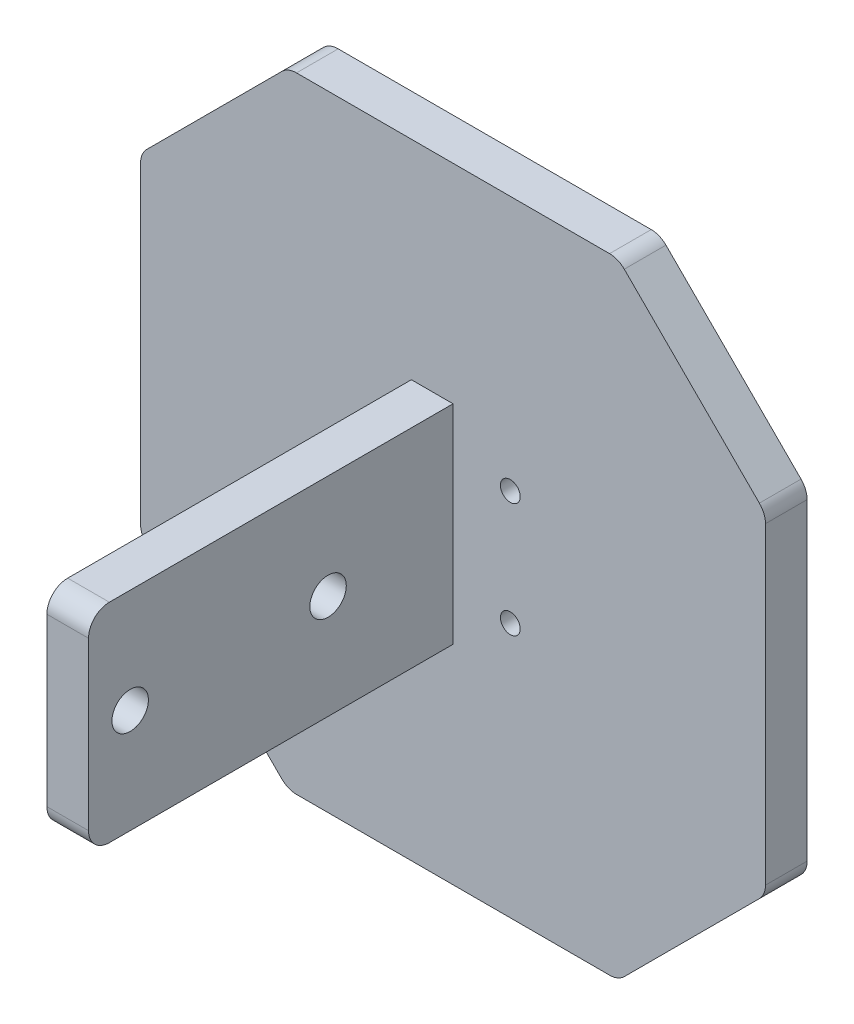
ISO-10303-21;
HEADER;
FILE_DESCRIPTION(('STEP AP214'),'2;1');
FILE_NAME('part.step','',(''),(''),'','','');
FILE_SCHEMA(('AUTOMOTIVE_DESIGN { 1 0 10303 214 1 1 1 1 }'));
ENDSEC;
DATA;
#1=APPLICATION_CONTEXT('core data for automotive mechanical design processes');
#2=APPLICATION_PROTOCOL_DEFINITION('international standard','automotive_design',2000,#1);
#3=PRODUCT_CONTEXT('',#1,'mechanical');
#4=PRODUCT('Part','Part','',(#3));
#5=PRODUCT_RELATED_PRODUCT_CATEGORY('part','',(#4));
#6=PRODUCT_DEFINITION_FORMATION('','',#4);
#7=PRODUCT_DEFINITION_CONTEXT('part definition',#1,'design');
#8=PRODUCT_DEFINITION('design','',#6,#7);
#9=PRODUCT_DEFINITION_SHAPE('','',#8);
#10=(LENGTH_UNIT() NAMED_UNIT(*) SI_UNIT(.MILLI.,.METRE.));
#11=(NAMED_UNIT(*) PLANE_ANGLE_UNIT() SI_UNIT($,.RADIAN.));
#12=(NAMED_UNIT(*) SI_UNIT($,.STERADIAN.) SOLID_ANGLE_UNIT());
#13=UNCERTAINTY_MEASURE_WITH_UNIT(LENGTH_MEASURE(1.E-05),#10,'distance_accuracy_value','');
#14=(GEOMETRIC_REPRESENTATION_CONTEXT(3) GLOBAL_UNCERTAINTY_ASSIGNED_CONTEXT((#13)) GLOBAL_UNIT_ASSIGNED_CONTEXT((#10,
#11,#12)) REPRESENTATION_CONTEXT('',''));
#15=CARTESIAN_POINT('',(0.,0.,0.));
#16=DIRECTION('',(0.,0.,1.));
#17=DIRECTION('',(1.,0.,0.));
#18=AXIS2_PLACEMENT_3D('',#15,#16,#17);
#19=CARTESIAN_POINT('',(0.,0.,4.));
#20=DIRECTION('',(0.,0.,-1.));
#21=DIRECTION('',(-1.,0.,0.));
#22=AXIS2_PLACEMENT_3D('',#19,#20,#21);
#23=PLANE('',#22);
#24=CARTESIAN_POINT('',(5.5,-5.50000000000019,4.));
#25=DIRECTION('',(0.,0.,1.));
#26=DIRECTION('',(1.,0.,0.));
#27=AXIS2_PLACEMENT_3D('',#24,#25,#26);
#28=CIRCLE('',#27,0.949999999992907);
#29=CARTESIAN_POINT('',(6.44999999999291,-5.50000000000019,4.));
#30=VERTEX_POINT('',#29);
#31=EDGE_CURVE('E222',#30,#30,#28,.T.);
#32=ORIENTED_EDGE('',*,*,#31,.F.);
#33=EDGE_LOOP('',(#32));
#34=FACE_BOUND('',#33,.T.);
#35=CARTESIAN_POINT('',(-5.5,-5.50000000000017,4.));
#36=DIRECTION('',(0.,0.,1.));
#37=DIRECTION('',(1.,0.,0.));
#38=AXIS2_PLACEMENT_3D('',#35,#36,#37);
#39=CIRCLE('',#38,0.949999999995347);
#40=CARTESIAN_POINT('',(-4.55000000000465,-5.50000000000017,4.));
#41=VERTEX_POINT('',#40);
#42=EDGE_CURVE('E234',#41,#41,#39,.T.);
#43=ORIENTED_EDGE('',*,*,#42,.F.);
#44=EDGE_LOOP('',(#43));
#45=FACE_BOUND('',#44,.T.);
#46=DIRECTION('',(-0.707106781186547,-0.707106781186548,0.));
#47=VECTOR('',#46,1.);
#48=CARTESIAN_POINT('',(-15.8578643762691,30.,4.));
#49=LINE('',#48,#47);
#50=CARTESIAN_POINT('',(-16.443650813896,29.4142135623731,4.));
#51=VERTEX_POINT('',#50);
#52=CARTESIAN_POINT('',(-29.4142135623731,16.4436508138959,4.));
#53=VERTEX_POINT('',#52);
#54=EDGE_CURVE('E253',#51,#53,#49,.T.);
#55=ORIENTED_EDGE('',*,*,#54,.T.);
#56=CARTESIAN_POINT('',(-28.,15.0294372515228,4.));
#57=DIRECTION('',(0.,0.,-1.));
#58=DIRECTION('',(-1.,0.,0.));
#59=AXIS2_PLACEMENT_3D('',#56,#57,#58);
#60=CIRCLE('',#59,2.);
#61=CARTESIAN_POINT('',(-30.,15.0294372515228,4.));
#62=VERTEX_POINT('',#61);
#63=EDGE_CURVE('E346',#53,#62,#60,.F.);
#64=ORIENTED_EDGE('',*,*,#63,.T.);
#65=DIRECTION('',(0.,-1.,0.));
#66=VECTOR('',#65,1.);
#67=CARTESIAN_POINT('',(-30.,15.857864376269,4.));
#68=LINE('',#67,#66);
#69=CARTESIAN_POINT('',(-30.,-15.0294372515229,4.));
#70=VERTEX_POINT('',#69);
#71=EDGE_CURVE('E256',#62,#70,#68,.T.);
#72=ORIENTED_EDGE('',*,*,#71,.T.);
#73=CARTESIAN_POINT('',(-28.,-15.0294372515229,4.));
#74=DIRECTION('',(0.,0.,-1.));
#75=DIRECTION('',(-1.,0.,0.));
#76=AXIS2_PLACEMENT_3D('',#73,#74,#75);
#77=CIRCLE('',#76,2.);
#78=CARTESIAN_POINT('',(-29.4142135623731,-16.443650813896,4.));
#79=VERTEX_POINT('',#78);
#80=EDGE_CURVE('E344',#70,#79,#77,.F.);
#81=ORIENTED_EDGE('',*,*,#80,.T.);
#82=DIRECTION('',(0.707106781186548,-0.707106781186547,0.));
#83=VECTOR('',#82,1.);
#84=CARTESIAN_POINT('',(-30.,-15.8578643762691,4.));
#85=LINE('',#84,#83);
#86=CARTESIAN_POINT('',(-16.443650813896,-29.4142135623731,4.));
#87=VERTEX_POINT('',#86);
#88=EDGE_CURVE('E259',#79,#87,#85,.T.);
#89=ORIENTED_EDGE('',*,*,#88,.T.);
#90=CARTESIAN_POINT('',(-15.0294372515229,-28.,4.));
#91=DIRECTION('',(0.,0.,-1.));
#92=DIRECTION('',(-1.,0.,0.));
#93=AXIS2_PLACEMENT_3D('',#90,#91,#92);
#94=CIRCLE('',#93,2.);
#95=CARTESIAN_POINT('',(-15.0294372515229,-30.,4.));
#96=VERTEX_POINT('',#95);
#97=EDGE_CURVE('E342',#87,#96,#94,.F.);
#98=ORIENTED_EDGE('',*,*,#97,.T.);
#99=DIRECTION('',(1.,0.,0.));
#100=VECTOR('',#99,1.);
#101=CARTESIAN_POINT('',(-15.8578643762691,-30.,4.));
#102=LINE('',#101,#100);
#103=CARTESIAN_POINT('',(15.0294372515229,-30.,4.));
#104=VERTEX_POINT('',#103);
#105=EDGE_CURVE('E262',#96,#104,#102,.T.);
#106=ORIENTED_EDGE('',*,*,#105,.T.);
#107=CARTESIAN_POINT('',(15.0294372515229,-28.,4.));
#108=DIRECTION('',(0.,0.,-1.));
#109=DIRECTION('',(-1.,0.,0.));
#110=AXIS2_PLACEMENT_3D('',#107,#108,#109);
#111=CIRCLE('',#110,2.);
#112=CARTESIAN_POINT('',(16.443650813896,-29.4142135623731,4.));
#113=VERTEX_POINT('',#112);
#114=EDGE_CURVE('E340',#104,#113,#111,.F.);
#115=ORIENTED_EDGE('',*,*,#114,.T.);
#116=DIRECTION('',(0.707106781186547,0.707106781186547,0.));
#117=VECTOR('',#116,1.);
#118=CARTESIAN_POINT('',(30.,-15.857864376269,4.));
#119=LINE('',#118,#117);
#120=CARTESIAN_POINT('',(29.4142135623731,-16.4436508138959,4.));
#121=VERTEX_POINT('',#120);
#122=EDGE_CURVE('E265',#113,#121,#119,.T.);
#123=ORIENTED_EDGE('',*,*,#122,.T.);
#124=CARTESIAN_POINT('',(28.,-15.0294372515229,4.));
#125=DIRECTION('',(0.,0.,-1.));
#126=DIRECTION('',(-1.,0.,0.));
#127=AXIS2_PLACEMENT_3D('',#124,#125,#126);
#128=CIRCLE('',#127,2.);
#129=CARTESIAN_POINT('',(30.,-15.0294372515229,4.));
#130=VERTEX_POINT('',#129);
#131=EDGE_CURVE('E54',#121,#130,#128,.F.);
#132=ORIENTED_EDGE('',*,*,#131,.T.);
#133=DIRECTION('',(0.,1.,0.));
#134=VECTOR('',#133,1.);
#135=CARTESIAN_POINT('',(30.,15.857864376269,4.));
#136=LINE('',#135,#134);
#137=CARTESIAN_POINT('',(30.,15.0294372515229,4.));
#138=VERTEX_POINT('',#137);
#139=EDGE_CURVE('E267',#130,#138,#136,.T.);
#140=ORIENTED_EDGE('',*,*,#139,.T.);
#141=CARTESIAN_POINT('',(28.,15.0294372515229,4.));
#142=DIRECTION('',(0.,0.,-1.));
#143=DIRECTION('',(-1.,0.,0.));
#144=AXIS2_PLACEMENT_3D('',#141,#142,#143);
#145=CIRCLE('',#144,2.);
#146=CARTESIAN_POINT('',(29.4142135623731,16.4436508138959,4.));
#147=VERTEX_POINT('',#146);
#148=EDGE_CURVE('E337',#138,#147,#145,.F.);
#149=ORIENTED_EDGE('',*,*,#148,.T.);
#150=DIRECTION('',(-0.707106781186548,0.707106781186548,0.));
#151=VECTOR('',#150,1.);
#152=CARTESIAN_POINT('',(15.8578643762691,30.,4.));
#153=LINE('',#152,#151);
#154=CARTESIAN_POINT('',(16.4436508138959,29.4142135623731,4.));
#155=VERTEX_POINT('',#154);
#156=EDGE_CURVE('E246',#147,#155,#153,.T.);
#157=ORIENTED_EDGE('',*,*,#156,.T.);
#158=CARTESIAN_POINT('',(15.0294372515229,28.,4.));
#159=DIRECTION('',(0.,0.,-1.));
#160=DIRECTION('',(-1.,0.,0.));
#161=AXIS2_PLACEMENT_3D('',#158,#159,#160);
#162=CIRCLE('',#161,2.);
#163=CARTESIAN_POINT('',(15.0294372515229,30.,4.));
#164=VERTEX_POINT('',#163);
#165=EDGE_CURVE('E335',#155,#164,#162,.F.);
#166=ORIENTED_EDGE('',*,*,#165,.T.);
#167=DIRECTION('',(-1.,0.,0.));
#168=VECTOR('',#167,1.);
#169=CARTESIAN_POINT('',(-15.8578643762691,30.,4.));
#170=LINE('',#169,#168);
#171=CARTESIAN_POINT('',(-15.0294372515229,30.,4.));
#172=VERTEX_POINT('',#171);
#173=EDGE_CURVE('E249',#164,#172,#170,.T.);
#174=ORIENTED_EDGE('',*,*,#173,.T.);
#175=CARTESIAN_POINT('',(-15.0294372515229,28.,4.));
#176=DIRECTION('',(0.,0.,-1.));
#177=DIRECTION('',(-1.,0.,0.));
#178=AXIS2_PLACEMENT_3D('',#175,#176,#177);
#179=CIRCLE('',#178,2.);
#180=EDGE_CURVE('E333',#172,#51,#179,.F.);
#181=ORIENTED_EDGE('',*,*,#180,.T.);
#182=EDGE_LOOP('',(#55,#64,#72,#81,#89,#98,#106,#115,#123,#132,#140,#149,#157,#166,#174,#181));
#183=FACE_BOUND('',#182,.T.);
#184=CARTESIAN_POINT('',(-5.5,5.49999999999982,4.));
#185=DIRECTION('',(0.,0.,1.));
#186=DIRECTION('',(1.,0.,0.));
#187=AXIS2_PLACEMENT_3D('',#184,#185,#186);
#188=CIRCLE('',#187,0.950000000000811);
#189=CARTESIAN_POINT('',(-4.54999999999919,5.49999999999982,4.));
#190=VERTEX_POINT('',#189);
#191=EDGE_CURVE('E240',#190,#190,#188,.T.);
#192=ORIENTED_EDGE('',*,*,#191,.F.);
#193=EDGE_LOOP('',(#192));
#194=FACE_BOUND('',#193,.T.);
#195=CARTESIAN_POINT('',(5.5,5.49999999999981,4.));
#196=DIRECTION('',(0.,0.,1.));
#197=DIRECTION('',(1.,0.,0.));
#198=AXIS2_PLACEMENT_3D('',#195,#196,#197);
#199=CIRCLE('',#198,0.950000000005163);
#200=CARTESIAN_POINT('',(6.45000000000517,5.49999999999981,4.));
#201=VERTEX_POINT('',#200);
#202=EDGE_CURVE('E228',#201,#201,#199,.T.);
#203=ORIENTED_EDGE('',*,*,#202,.F.);
#204=EDGE_LOOP('',(#203));
#205=FACE_BOUND('',#204,.T.);
#206=DIRECTION('',(0.,-1.,0.));
#207=VECTOR('',#206,1.);
#208=CARTESIAN_POINT('',(-4.,-10.,4.));
#209=LINE('',#208,#207);
#210=CARTESIAN_POINT('',(-4.,10.,4.));
#211=VERTEX_POINT('',#210);
#212=CARTESIAN_POINT('',(-4.,-10.,4.));
#213=VERTEX_POINT('',#212);
#214=EDGE_CURVE('E188',#211,#213,#209,.T.);
#215=ORIENTED_EDGE('',*,*,#214,.F.);
#216=DIRECTION('',(-1.,0.,0.));
#217=VECTOR('',#216,1.);
#218=CARTESIAN_POINT('',(-4.,10.,4.));
#219=LINE('',#218,#217);
#220=CARTESIAN_POINT('',(0.,10.,4.));
#221=VERTEX_POINT('',#220);
#222=EDGE_CURVE('E200',#221,#211,#219,.T.);
#223=ORIENTED_EDGE('',*,*,#222,.F.);
#224=DIRECTION('',(0.,1.,0.));
#225=VECTOR('',#224,1.);
#226=CARTESIAN_POINT('',(0.,-10.,4.));
#227=LINE('',#226,#225);
#228=CARTESIAN_POINT('',(0.,-10.,4.));
#229=VERTEX_POINT('',#228);
#230=EDGE_CURVE('E209',#229,#221,#227,.T.);
#231=ORIENTED_EDGE('',*,*,#230,.F.);
#232=DIRECTION('',(1.,0.,0.));
#233=VECTOR('',#232,1.);
#234=CARTESIAN_POINT('',(-4.,-10.,4.));
#235=LINE('',#234,#233);
#236=EDGE_CURVE('E203',#213,#229,#235,.T.);
#237=ORIENTED_EDGE('',*,*,#236,.F.);
#238=EDGE_LOOP('',(#215,#223,#231,#237));
#239=FACE_BOUND('',#238,.T.);
#240=ADVANCED_FACE('F32',(#34,#45,#183,#194,#205,#239),#23,.F.);
#241=CARTESIAN_POINT('',(0.,0.,0.));
#242=DIRECTION('',(0.,0.,-1.));
#243=DIRECTION('',(-1.,0.,0.));
#244=AXIS2_PLACEMENT_3D('',#241,#242,#243);
#245=PLANE('',#244);
#246=CARTESIAN_POINT('',(5.5,5.49999999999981,0.));
#247=DIRECTION('',(0.,0.,1.));
#248=DIRECTION('',(1.,0.,0.));
#249=AXIS2_PLACEMENT_3D('',#246,#247,#248);
#250=CIRCLE('',#249,0.950000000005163);
#251=CARTESIAN_POINT('',(6.45000000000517,5.49999999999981,0.));
#252=VERTEX_POINT('',#251);
#253=EDGE_CURVE('E225',#252,#252,#250,.T.);
#254=ORIENTED_EDGE('',*,*,#253,.T.);
#255=EDGE_LOOP('',(#254));
#256=FACE_BOUND('',#255,.T.);
#257=CARTESIAN_POINT('',(-5.5,5.49999999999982,0.));
#258=DIRECTION('',(0.,0.,1.));
#259=DIRECTION('',(1.,0.,0.));
#260=AXIS2_PLACEMENT_3D('',#257,#258,#259);
#261=CIRCLE('',#260,0.950000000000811);
#262=CARTESIAN_POINT('',(-4.54999999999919,5.49999999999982,0.));
#263=VERTEX_POINT('',#262);
#264=EDGE_CURVE('E237',#263,#263,#261,.T.);
#265=ORIENTED_EDGE('',*,*,#264,.T.);
#266=EDGE_LOOP('',(#265));
#267=FACE_BOUND('',#266,.T.);
#268=DIRECTION('',(0.,-1.,0.));
#269=VECTOR('',#268,1.);
#270=CARTESIAN_POINT('',(-30.,15.857864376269,0.));
#271=LINE('',#270,#269);
#272=CARTESIAN_POINT('',(-30.,15.0294372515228,0.));
#273=VERTEX_POINT('',#272);
#274=CARTESIAN_POINT('',(-30.,-15.0294372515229,0.));
#275=VERTEX_POINT('',#274);
#276=EDGE_CURVE('E278',#273,#275,#271,.T.);
#277=ORIENTED_EDGE('',*,*,#276,.F.);
#278=CARTESIAN_POINT('',(-28.,15.0294372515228,0.));
#279=DIRECTION('',(0.,0.,-1.));
#280=DIRECTION('',(-1.,0.,0.));
#281=AXIS2_PLACEMENT_3D('',#278,#279,#280);
#282=CIRCLE('',#281,2.);
#283=CARTESIAN_POINT('',(-29.4142135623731,16.4436508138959,0.));
#284=VERTEX_POINT('',#283);
#285=EDGE_CURVE('E326',#273,#284,#282,.T.);
#286=ORIENTED_EDGE('',*,*,#285,.T.);
#287=DIRECTION('',(-0.707106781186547,-0.707106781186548,0.));
#288=VECTOR('',#287,1.);
#289=CARTESIAN_POINT('',(-15.8578643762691,30.,0.));
#290=LINE('',#289,#288);
#291=CARTESIAN_POINT('',(-16.443650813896,29.4142135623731,0.));
#292=VERTEX_POINT('',#291);
#293=EDGE_CURVE('E275',#292,#284,#290,.T.);
#294=ORIENTED_EDGE('',*,*,#293,.F.);
#295=CARTESIAN_POINT('',(-15.0294372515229,28.,0.));
#296=DIRECTION('',(0.,0.,-1.));
#297=DIRECTION('',(-1.,0.,0.));
#298=AXIS2_PLACEMENT_3D('',#295,#296,#297);
#299=CIRCLE('',#298,2.);
#300=CARTESIAN_POINT('',(-15.0294372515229,30.,0.));
#301=VERTEX_POINT('',#300);
#302=EDGE_CURVE('E312',#292,#301,#299,.T.);
#303=ORIENTED_EDGE('',*,*,#302,.T.);
#304=DIRECTION('',(-1.,0.,0.));
#305=VECTOR('',#304,1.);
#306=CARTESIAN_POINT('',(-15.8578643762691,30.,0.));
#307=LINE('',#306,#305);
#308=CARTESIAN_POINT('',(15.0294372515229,30.,0.));
#309=VERTEX_POINT('',#308);
#310=EDGE_CURVE('E272',#309,#301,#307,.T.);
#311=ORIENTED_EDGE('',*,*,#310,.F.);
#312=CARTESIAN_POINT('',(15.0294372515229,28.,0.));
#313=DIRECTION('',(0.,0.,-1.));
#314=DIRECTION('',(-1.,0.,0.));
#315=AXIS2_PLACEMENT_3D('',#312,#313,#314);
#316=CIRCLE('',#315,2.);
#317=CARTESIAN_POINT('',(16.4436508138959,29.4142135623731,0.));
#318=VERTEX_POINT('',#317);
#319=EDGE_CURVE('E314',#309,#318,#316,.T.);
#320=ORIENTED_EDGE('',*,*,#319,.T.);
#321=DIRECTION('',(-0.707106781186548,0.707106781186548,0.));
#322=VECTOR('',#321,1.);
#323=CARTESIAN_POINT('',(15.8578643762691,30.,0.));
#324=LINE('',#323,#322);
#325=CARTESIAN_POINT('',(29.4142135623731,16.4436508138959,0.));
#326=VERTEX_POINT('',#325);
#327=EDGE_CURVE('E243',#326,#318,#324,.T.);
#328=ORIENTED_EDGE('',*,*,#327,.F.);
#329=CARTESIAN_POINT('',(28.,15.0294372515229,0.));
#330=DIRECTION('',(0.,0.,-1.));
#331=DIRECTION('',(-1.,0.,0.));
#332=AXIS2_PLACEMENT_3D('',#329,#330,#331);
#333=CIRCLE('',#332,2.);
#334=CARTESIAN_POINT('',(30.,15.0294372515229,0.));
#335=VERTEX_POINT('',#334);
#336=EDGE_CURVE('E316',#326,#335,#333,.T.);
#337=ORIENTED_EDGE('',*,*,#336,.T.);
#338=DIRECTION('',(0.,1.,0.));
#339=VECTOR('',#338,1.);
#340=CARTESIAN_POINT('',(30.,15.857864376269,0.));
#341=LINE('',#340,#339);
#342=CARTESIAN_POINT('',(30.,-15.0294372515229,0.));
#343=VERTEX_POINT('',#342);
#344=EDGE_CURVE('E250',#343,#335,#341,.T.);
#345=ORIENTED_EDGE('',*,*,#344,.F.);
#346=CARTESIAN_POINT('',(28.,-15.0294372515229,0.));
#347=DIRECTION('',(0.,0.,-1.));
#348=DIRECTION('',(-1.,0.,0.));
#349=AXIS2_PLACEMENT_3D('',#346,#347,#348);
#350=CIRCLE('',#349,2.);
#351=CARTESIAN_POINT('',(29.4142135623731,-16.4436508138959,0.));
#352=VERTEX_POINT('',#351);
#353=EDGE_CURVE('E318',#343,#352,#350,.T.);
#354=ORIENTED_EDGE('',*,*,#353,.T.);
#355=DIRECTION('',(0.707106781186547,0.707106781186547,0.));
#356=VECTOR('',#355,1.);
#357=CARTESIAN_POINT('',(30.,-15.857864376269,0.));
#358=LINE('',#357,#356);
#359=CARTESIAN_POINT('',(16.443650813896,-29.4142135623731,0.));
#360=VERTEX_POINT('',#359);
#361=EDGE_CURVE('E287',#360,#352,#358,.T.);
#362=ORIENTED_EDGE('',*,*,#361,.F.);
#363=CARTESIAN_POINT('',(15.0294372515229,-28.,0.));
#364=DIRECTION('',(0.,0.,-1.));
#365=DIRECTION('',(-1.,0.,0.));
#366=AXIS2_PLACEMENT_3D('',#363,#364,#365);
#367=CIRCLE('',#366,2.);
#368=CARTESIAN_POINT('',(15.0294372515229,-30.,0.));
#369=VERTEX_POINT('',#368);
#370=EDGE_CURVE('E320',#360,#369,#367,.T.);
#371=ORIENTED_EDGE('',*,*,#370,.T.);
#372=DIRECTION('',(1.,0.,0.));
#373=VECTOR('',#372,1.);
#374=CARTESIAN_POINT('',(-15.8578643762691,-30.,0.));
#375=LINE('',#374,#373);
#376=CARTESIAN_POINT('',(-15.0294372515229,-30.,0.));
#377=VERTEX_POINT('',#376);
#378=EDGE_CURVE('E284',#377,#369,#375,.T.);
#379=ORIENTED_EDGE('',*,*,#378,.F.);
#380=CARTESIAN_POINT('',(-15.0294372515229,-28.,0.));
#381=DIRECTION('',(0.,0.,-1.));
#382=DIRECTION('',(-1.,0.,0.));
#383=AXIS2_PLACEMENT_3D('',#380,#381,#382);
#384=CIRCLE('',#383,2.);
#385=CARTESIAN_POINT('',(-16.443650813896,-29.4142135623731,0.));
#386=VERTEX_POINT('',#385);
#387=EDGE_CURVE('E322',#377,#386,#384,.T.);
#388=ORIENTED_EDGE('',*,*,#387,.T.);
#389=DIRECTION('',(0.707106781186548,-0.707106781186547,0.));
#390=VECTOR('',#389,1.);
#391=CARTESIAN_POINT('',(-30.,-15.8578643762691,0.));
#392=LINE('',#391,#390);
#393=CARTESIAN_POINT('',(-29.4142135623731,-16.443650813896,0.));
#394=VERTEX_POINT('',#393);
#395=EDGE_CURVE('E281',#394,#386,#392,.T.);
#396=ORIENTED_EDGE('',*,*,#395,.F.);
#397=CARTESIAN_POINT('',(-28.,-15.0294372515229,0.));
#398=DIRECTION('',(0.,0.,-1.));
#399=DIRECTION('',(-1.,0.,0.));
#400=AXIS2_PLACEMENT_3D('',#397,#398,#399);
#401=CIRCLE('',#400,2.);
#402=EDGE_CURVE('E324',#394,#275,#401,.T.);
#403=ORIENTED_EDGE('',*,*,#402,.T.);
#404=EDGE_LOOP('',(#277,#286,#294,#303,#311,#320,#328,#337,#345,#354,#362,#371,#379,#388,#396,#403));
#405=FACE_BOUND('',#404,.T.);
#406=CARTESIAN_POINT('',(-5.5,-5.50000000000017,0.));
#407=DIRECTION('',(0.,0.,1.));
#408=DIRECTION('',(1.,0.,0.));
#409=AXIS2_PLACEMENT_3D('',#406,#407,#408);
#410=CIRCLE('',#409,0.949999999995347);
#411=CARTESIAN_POINT('',(-4.55000000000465,-5.50000000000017,0.));
#412=VERTEX_POINT('',#411);
#413=EDGE_CURVE('E231',#412,#412,#410,.T.);
#414=ORIENTED_EDGE('',*,*,#413,.T.);
#415=EDGE_LOOP('',(#414));
#416=FACE_BOUND('',#415,.T.);
#417=CARTESIAN_POINT('',(5.5,-5.50000000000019,0.));
#418=DIRECTION('',(0.,0.,1.));
#419=DIRECTION('',(1.,0.,0.));
#420=AXIS2_PLACEMENT_3D('',#417,#418,#419);
#421=CIRCLE('',#420,0.949999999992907);
#422=CARTESIAN_POINT('',(6.44999999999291,-5.50000000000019,0.));
#423=VERTEX_POINT('',#422);
#424=EDGE_CURVE('E221',#423,#423,#421,.T.);
#425=ORIENTED_EDGE('',*,*,#424,.T.);
#426=EDGE_LOOP('',(#425));
#427=FACE_BOUND('',#426,.T.);
#428=ADVANCED_FACE('F389',(#256,#267,#405,#416,#427),#245,.T.);
#429=CARTESIAN_POINT('',(15.8578643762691,30.,4.));
#430=DIRECTION('',(-0.707106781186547,-0.707106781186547,0.));
#431=DIRECTION('',(0.707106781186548,-0.707106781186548,0.));
#432=AXIS2_PLACEMENT_3D('',#429,#430,#431);
#433=PLANE('',#432);
#434=ORIENTED_EDGE('',*,*,#156,.F.);
#435=DIRECTION('',(0.,0.,-1.));
#436=VECTOR('',#435,1.);
#437=CARTESIAN_POINT('',(29.4142135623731,16.4436508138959,4.));
#438=LINE('',#437,#436);
#439=EDGE_CURVE('E369',#147,#326,#438,.T.);
#440=ORIENTED_EDGE('',*,*,#439,.T.);
#441=ORIENTED_EDGE('',*,*,#327,.T.);
#442=DIRECTION('',(0.,0.,-1.));
#443=VECTOR('',#442,1.);
#444=CARTESIAN_POINT('',(16.4436508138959,29.4142135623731,4.));
#445=LINE('',#444,#443);
#446=EDGE_CURVE('E367',#318,#155,#445,.F.);
#447=ORIENTED_EDGE('',*,*,#446,.T.);
#448=EDGE_LOOP('',(#434,#440,#441,#447));
#449=FACE_BOUND('',#448,.T.);
#450=ADVANCED_FACE('F438',(#449),#433,.F.);
#451=CARTESIAN_POINT('',(-15.8578643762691,30.,4.));
#452=DIRECTION('',(0.,-1.,0.));
#453=DIRECTION('',(1.,0.,0.));
#454=AXIS2_PLACEMENT_3D('',#451,#452,#453);
#455=PLANE('',#454);
#456=ORIENTED_EDGE('',*,*,#173,.F.);
#457=DIRECTION('',(0.,0.,-1.));
#458=VECTOR('',#457,1.);
#459=CARTESIAN_POINT('',(15.0294372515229,30.,4.));
#460=LINE('',#459,#458);
#461=EDGE_CURVE('E11',#164,#309,#460,.T.);
#462=ORIENTED_EDGE('',*,*,#461,.T.);
#463=ORIENTED_EDGE('',*,*,#310,.T.);
#464=DIRECTION('',(0.,0.,-1.));
#465=VECTOR('',#464,1.);
#466=CARTESIAN_POINT('',(-15.0294372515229,30.,4.));
#467=LINE('',#466,#465);
#468=EDGE_CURVE('E40',#301,#172,#467,.F.);
#469=ORIENTED_EDGE('',*,*,#468,.T.);
#470=EDGE_LOOP('',(#456,#462,#463,#469));
#471=FACE_BOUND('',#470,.T.);
#472=ADVANCED_FACE('F374',(#471),#455,.F.);
#473=CARTESIAN_POINT('',(-15.8578643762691,30.,4.));
#474=DIRECTION('',(0.707106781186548,-0.707106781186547,0.));
#475=DIRECTION('',(0.707106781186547,0.707106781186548,0.));
#476=AXIS2_PLACEMENT_3D('',#473,#474,#475);
#477=PLANE('',#476);
#478=ORIENTED_EDGE('',*,*,#293,.T.);
#479=DIRECTION('',(0.,0.,-1.));
#480=VECTOR('',#479,1.);
#481=CARTESIAN_POINT('',(-29.4142135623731,16.4436508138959,4.));
#482=LINE('',#481,#480);
#483=EDGE_CURVE('E331',#284,#53,#482,.F.);
#484=ORIENTED_EDGE('',*,*,#483,.T.);
#485=ORIENTED_EDGE('',*,*,#54,.F.);
#486=DIRECTION('',(0.,0.,-1.));
#487=VECTOR('',#486,1.);
#488=CARTESIAN_POINT('',(-16.443650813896,29.4142135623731,4.));
#489=LINE('',#488,#487);
#490=EDGE_CURVE('E328',#51,#292,#489,.T.);
#491=ORIENTED_EDGE('',*,*,#490,.T.);
#492=EDGE_LOOP('',(#478,#484,#485,#491));
#493=FACE_BOUND('',#492,.T.);
#494=ADVANCED_FACE('F385',(#493),#477,.F.);
#495=CARTESIAN_POINT('',(-30.,15.857864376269,4.));
#496=DIRECTION('',(1.,0.,0.));
#497=DIRECTION('',(0.,1.,0.));
#498=AXIS2_PLACEMENT_3D('',#495,#496,#497);
#499=PLANE('',#498);
#500=ORIENTED_EDGE('',*,*,#71,.F.);
#501=DIRECTION('',(0.,0.,-1.));
#502=VECTOR('',#501,1.);
#503=CARTESIAN_POINT('',(-30.,15.0294372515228,4.));
#504=LINE('',#503,#502);
#505=EDGE_CURVE('E309',#62,#273,#504,.T.);
#506=ORIENTED_EDGE('',*,*,#505,.T.);
#507=ORIENTED_EDGE('',*,*,#276,.T.);
#508=DIRECTION('',(0.,0.,-1.));
#509=VECTOR('',#508,1.);
#510=CARTESIAN_POINT('',(-30.,-15.0294372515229,4.));
#511=LINE('',#510,#509);
#512=EDGE_CURVE('E307',#275,#70,#511,.F.);
#513=ORIENTED_EDGE('',*,*,#512,.T.);
#514=EDGE_LOOP('',(#500,#506,#507,#513));
#515=FACE_BOUND('',#514,.T.);
#516=ADVANCED_FACE('F397',(#515),#499,.F.);
#517=CARTESIAN_POINT('',(-30.,-15.8578643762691,4.));
#518=DIRECTION('',(0.707106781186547,0.707106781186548,0.));
#519=DIRECTION('',(-0.707106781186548,0.707106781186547,0.));
#520=AXIS2_PLACEMENT_3D('',#517,#518,#519);
#521=PLANE('',#520);
#522=ORIENTED_EDGE('',*,*,#88,.F.);
#523=DIRECTION('',(0.,0.,-1.));
#524=VECTOR('',#523,1.);
#525=CARTESIAN_POINT('',(-29.4142135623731,-16.443650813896,4.));
#526=LINE('',#525,#524);
#527=EDGE_CURVE('E350',#79,#394,#526,.T.);
#528=ORIENTED_EDGE('',*,*,#527,.T.);
#529=ORIENTED_EDGE('',*,*,#395,.T.);
#530=DIRECTION('',(0.,0.,-1.));
#531=VECTOR('',#530,1.);
#532=CARTESIAN_POINT('',(-16.443650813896,-29.4142135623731,4.));
#533=LINE('',#532,#531);
#534=EDGE_CURVE('E348',#386,#87,#533,.F.);
#535=ORIENTED_EDGE('',*,*,#534,.T.);
#536=EDGE_LOOP('',(#522,#528,#529,#535));
#537=FACE_BOUND('',#536,.T.);
#538=ADVANCED_FACE('F406',(#537),#521,.F.);
#539=CARTESIAN_POINT('',(-15.8578643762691,-30.,4.));
#540=DIRECTION('',(0.,1.,0.));
#541=DIRECTION('',(0.,0.,1.));
#542=AXIS2_PLACEMENT_3D('',#539,#540,#541);
#543=PLANE('',#542);
#544=ORIENTED_EDGE('',*,*,#105,.F.);
#545=DIRECTION('',(0.,0.,-1.));
#546=VECTOR('',#545,1.);
#547=CARTESIAN_POINT('',(-15.0294372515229,-30.,4.));
#548=LINE('',#547,#546);
#549=EDGE_CURVE('E355',#96,#377,#548,.T.);
#550=ORIENTED_EDGE('',*,*,#549,.T.);
#551=ORIENTED_EDGE('',*,*,#378,.T.);
#552=DIRECTION('',(0.,0.,-1.));
#553=VECTOR('',#552,1.);
#554=CARTESIAN_POINT('',(15.0294372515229,-30.,4.));
#555=LINE('',#554,#553);
#556=EDGE_CURVE('E353',#369,#104,#555,.F.);
#557=ORIENTED_EDGE('',*,*,#556,.T.);
#558=EDGE_LOOP('',(#544,#550,#551,#557));
#559=FACE_BOUND('',#558,.T.);
#560=ADVANCED_FACE('F415',(#559),#543,.F.);
#561=CARTESIAN_POINT('',(30.,-15.857864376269,4.));
#562=DIRECTION('',(-0.707106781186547,0.707106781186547,0.));
#563=DIRECTION('',(-0.707106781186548,-0.707106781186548,0.));
#564=AXIS2_PLACEMENT_3D('',#561,#562,#563);
#565=PLANE('',#564);
#566=ORIENTED_EDGE('',*,*,#122,.F.);
#567=DIRECTION('',(0.,0.,-1.));
#568=VECTOR('',#567,1.);
#569=CARTESIAN_POINT('',(16.443650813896,-29.4142135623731,4.));
#570=LINE('',#569,#568);
#571=EDGE_CURVE('E360',#113,#360,#570,.T.);
#572=ORIENTED_EDGE('',*,*,#571,.T.);
#573=ORIENTED_EDGE('',*,*,#361,.T.);
#574=DIRECTION('',(0.,0.,-1.));
#575=VECTOR('',#574,1.);
#576=CARTESIAN_POINT('',(29.4142135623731,-16.4436508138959,4.));
#577=LINE('',#576,#575);
#578=EDGE_CURVE('E358',#352,#121,#577,.F.);
#579=ORIENTED_EDGE('',*,*,#578,.T.);
#580=EDGE_LOOP('',(#566,#572,#573,#579));
#581=FACE_BOUND('',#580,.T.);
#582=ADVANCED_FACE('F424',(#581),#565,.F.);
#583=CARTESIAN_POINT('',(30.,15.857864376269,4.));
#584=DIRECTION('',(-1.,0.,0.));
#585=DIRECTION('',(0.,-1.,0.));
#586=AXIS2_PLACEMENT_3D('',#583,#584,#585);
#587=PLANE('',#586);
#588=ORIENTED_EDGE('',*,*,#139,.F.);
#589=DIRECTION('',(0.,0.,-1.));
#590=VECTOR('',#589,1.);
#591=CARTESIAN_POINT('',(30.,-15.0294372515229,4.));
#592=LINE('',#591,#590);
#593=EDGE_CURVE('E364',#130,#343,#592,.T.);
#594=ORIENTED_EDGE('',*,*,#593,.T.);
#595=ORIENTED_EDGE('',*,*,#344,.T.);
#596=DIRECTION('',(0.,0.,-1.));
#597=VECTOR('',#596,1.);
#598=CARTESIAN_POINT('',(30.,15.0294372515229,4.));
#599=LINE('',#598,#597);
#600=EDGE_CURVE('E47',#335,#138,#599,.F.);
#601=ORIENTED_EDGE('',*,*,#600,.T.);
#602=EDGE_LOOP('',(#588,#594,#595,#601));
#603=FACE_BOUND('',#602,.T.);
#604=ADVANCED_FACE('F430',(#603),#587,.F.);
#605=CARTESIAN_POINT('',(-5.5,5.49999999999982,4.));
#606=DIRECTION('',(0.,0.,-1.));
#607=DIRECTION('',(-1.,0.,0.));
#608=AXIS2_PLACEMENT_3D('',#605,#606,#607);
#609=CYLINDRICAL_SURFACE('',#608,0.950000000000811);
#610=ORIENTED_EDGE('',*,*,#264,.F.);
#611=EDGE_LOOP('',(#610));
#612=FACE_BOUND('',#611,.T.);
#613=ORIENTED_EDGE('',*,*,#191,.T.);
#614=EDGE_LOOP('',(#613));
#615=FACE_BOUND('',#614,.T.);
#616=ADVANCED_FACE('F459',(#612,#615),#609,.F.);
#617=CARTESIAN_POINT('',(-5.5,-5.50000000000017,4.));
#618=DIRECTION('',(0.,0.,-1.));
#619=DIRECTION('',(-1.,0.,0.));
#620=AXIS2_PLACEMENT_3D('',#617,#618,#619);
#621=CYLINDRICAL_SURFACE('',#620,0.949999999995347);
#622=ORIENTED_EDGE('',*,*,#413,.F.);
#623=EDGE_LOOP('',(#622));
#624=FACE_BOUND('',#623,.T.);
#625=ORIENTED_EDGE('',*,*,#42,.T.);
#626=EDGE_LOOP('',(#625));
#627=FACE_BOUND('',#626,.T.);
#628=ADVANCED_FACE('F630',(#624,#627),#621,.F.);
#629=CARTESIAN_POINT('',(5.5,5.49999999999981,4.));
#630=DIRECTION('',(0.,0.,-1.));
#631=DIRECTION('',(-1.,0.,0.));
#632=AXIS2_PLACEMENT_3D('',#629,#630,#631);
#633=CYLINDRICAL_SURFACE('',#632,0.950000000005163);
#634=ORIENTED_EDGE('',*,*,#202,.T.);
#635=EDGE_LOOP('',(#634));
#636=FACE_BOUND('',#635,.T.);
#637=ORIENTED_EDGE('',*,*,#253,.F.);
#638=EDGE_LOOP('',(#637));
#639=FACE_BOUND('',#638,.T.);
#640=ADVANCED_FACE('F621',(#636,#639),#633,.F.);
#641=CARTESIAN_POINT('',(5.5,-5.50000000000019,4.));
#642=DIRECTION('',(0.,0.,-1.));
#643=DIRECTION('',(-1.,0.,0.));
#644=AXIS2_PLACEMENT_3D('',#641,#642,#643);
#645=CYLINDRICAL_SURFACE('',#644,0.949999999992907);
#646=ORIENTED_EDGE('',*,*,#31,.T.);
#647=EDGE_LOOP('',(#646));
#648=FACE_BOUND('',#647,.T.);
#649=ORIENTED_EDGE('',*,*,#424,.F.);
#650=EDGE_LOOP('',(#649));
#651=FACE_BOUND('',#650,.T.);
#652=ADVANCED_FACE('F608',(#648,#651),#645,.F.);
#653=CARTESIAN_POINT('',(-4.,-10.,39.));
#654=DIRECTION('',(1.,0.,0.));
#655=DIRECTION('',(0.,0.,-1.));
#656=AXIS2_PLACEMENT_3D('',#653,#654,#655);
#657=PLANE('',#656);
#658=CARTESIAN_POINT('',(-4.,0.,35.));
#659=DIRECTION('',(1.,0.,0.));
#660=DIRECTION('',(0.,0.,-1.));
#661=AXIS2_PLACEMENT_3D('',#658,#659,#660);
#662=CIRCLE('',#661,1.75);
#663=CARTESIAN_POINT('',(-4.,0.,33.25));
#664=VERTEX_POINT('',#663);
#665=EDGE_CURVE('E738',#664,#664,#662,.T.);
#666=ORIENTED_EDGE('',*,*,#665,.T.);
#667=EDGE_LOOP('',(#666));
#668=FACE_BOUND('',#667,.T.);
#669=CARTESIAN_POINT('',(-4.,0.,16.));
#670=DIRECTION('',(1.,0.,0.));
#671=DIRECTION('',(0.,0.,-1.));
#672=AXIS2_PLACEMENT_3D('',#669,#670,#671);
#673=CIRCLE('',#672,1.75);
#674=CARTESIAN_POINT('',(-4.,0.,14.25));
#675=VERTEX_POINT('',#674);
#676=EDGE_CURVE('E204',#675,#675,#673,.T.);
#677=ORIENTED_EDGE('',*,*,#676,.T.);
#678=EDGE_LOOP('',(#677));
#679=FACE_BOUND('',#678,.T.);
#680=DIRECTION('',(0.,-1.,0.));
#681=VECTOR('',#680,1.);
#682=CARTESIAN_POINT('',(-4.,-10.,39.));
#683=LINE('',#682,#681);
#684=CARTESIAN_POINT('',(-4.,8.,39.));
#685=VERTEX_POINT('',#684);
#686=CARTESIAN_POINT('',(-4.,-8.,39.));
#687=VERTEX_POINT('',#686);
#688=EDGE_CURVE('E208',#685,#687,#683,.T.);
#689=ORIENTED_EDGE('',*,*,#688,.F.);
#690=CARTESIAN_POINT('',(-4.,8.,37.));
#691=DIRECTION('',(1.,0.,0.));
#692=DIRECTION('',(0.,0.,-1.));
#693=AXIS2_PLACEMENT_3D('',#690,#691,#692);
#694=CIRCLE('',#693,2.);
#695=CARTESIAN_POINT('',(-4.,10.,37.));
#696=VERTEX_POINT('',#695);
#697=EDGE_CURVE('E189',#685,#696,#694,.F.);
#698=ORIENTED_EDGE('',*,*,#697,.T.);
#699=DIRECTION('',(0.,0.,-1.));
#700=VECTOR('',#699,1.);
#701=CARTESIAN_POINT('',(-4.,10.,39.));
#702=LINE('',#701,#700);
#703=EDGE_CURVE('E183',#696,#211,#702,.T.);
#704=ORIENTED_EDGE('',*,*,#703,.T.);
#705=ORIENTED_EDGE('',*,*,#214,.T.);
#706=DIRECTION('',(0.,0.,-1.));
#707=VECTOR('',#706,1.);
#708=CARTESIAN_POINT('',(-4.,-10.,39.));
#709=LINE('',#708,#707);
#710=CARTESIAN_POINT('',(-4.,-10.,37.));
#711=VERTEX_POINT('',#710);
#712=EDGE_CURVE('E219',#711,#213,#709,.T.);
#713=ORIENTED_EDGE('',*,*,#712,.F.);
#714=CARTESIAN_POINT('',(-4.,-8.,37.));
#715=DIRECTION('',(1.,0.,0.));
#716=DIRECTION('',(0.,0.,-1.));
#717=AXIS2_PLACEMENT_3D('',#714,#715,#716);
#718=CIRCLE('',#717,2.);
#719=EDGE_CURVE('E296',#711,#687,#718,.F.);
#720=ORIENTED_EDGE('',*,*,#719,.T.);
#721=EDGE_LOOP('',(#689,#698,#704,#705,#713,#720));
#722=FACE_BOUND('',#721,.T.);
#723=ADVANCED_FACE('F186',(#668,#679,#722),#657,.F.);
#724=CARTESIAN_POINT('',(-4.,-10.,39.));
#725=DIRECTION('',(0.,1.,0.));
#726=DIRECTION('',(0.,0.,1.));
#727=AXIS2_PLACEMENT_3D('',#724,#725,#726);
#728=PLANE('',#727);
#729=DIRECTION('',(0.,0.,-1.));
#730=VECTOR('',#729,1.);
#731=CARTESIAN_POINT('',(0.,-10.,39.));
#732=LINE('',#731,#730);
#733=CARTESIAN_POINT('',(0.,-10.,37.));
#734=VERTEX_POINT('',#733);
#735=EDGE_CURVE('E217',#734,#229,#732,.T.);
#736=ORIENTED_EDGE('',*,*,#735,.F.);
#737=DIRECTION('',(1.,0.,0.));
#738=VECTOR('',#737,1.);
#739=CARTESIAN_POINT('',(-4.,-10.,37.));
#740=LINE('',#739,#738);
#741=EDGE_CURVE('E305',#734,#711,#740,.F.);
#742=ORIENTED_EDGE('',*,*,#741,.T.);
#743=ORIENTED_EDGE('',*,*,#712,.T.);
#744=ORIENTED_EDGE('',*,*,#236,.T.);
#745=EDGE_LOOP('',(#736,#742,#743,#744));
#746=FACE_BOUND('',#745,.T.);
#747=ADVANCED_FACE('F592',(#746),#728,.F.);
#748=CARTESIAN_POINT('',(0.,-10.,39.));
#749=DIRECTION('',(-1.,0.,0.));
#750=DIRECTION('',(0.,0.,1.));
#751=AXIS2_PLACEMENT_3D('',#748,#749,#750);
#752=PLANE('',#751);
#753=CARTESIAN_POINT('',(0.,0.,35.));
#754=DIRECTION('',(1.,0.,0.));
#755=DIRECTION('',(0.,0.,-1.));
#756=AXIS2_PLACEMENT_3D('',#753,#754,#755);
#757=CIRCLE('',#756,1.75);
#758=CARTESIAN_POINT('',(0.,0.,33.25));
#759=VERTEX_POINT('',#758);
#760=EDGE_CURVE('E758',#759,#759,#757,.T.);
#761=ORIENTED_EDGE('',*,*,#760,.F.);
#762=EDGE_LOOP('',(#761));
#763=FACE_BOUND('',#762,.T.);
#764=CARTESIAN_POINT('',(0.,0.,16.));
#765=DIRECTION('',(1.,0.,0.));
#766=DIRECTION('',(0.,0.,-1.));
#767=AXIS2_PLACEMENT_3D('',#764,#765,#766);
#768=CIRCLE('',#767,1.75);
#769=CARTESIAN_POINT('',(0.,0.,14.25));
#770=VERTEX_POINT('',#769);
#771=EDGE_CURVE('E742',#770,#770,#768,.T.);
#772=ORIENTED_EDGE('',*,*,#771,.F.);
#773=EDGE_LOOP('',(#772));
#774=FACE_BOUND('',#773,.T.);
#775=DIRECTION('',(0.,0.,-1.));
#776=VECTOR('',#775,1.);
#777=CARTESIAN_POINT('',(0.,10.,39.));
#778=LINE('',#777,#776);
#779=CARTESIAN_POINT('',(0.,10.,37.));
#780=VERTEX_POINT('',#779);
#781=EDGE_CURVE('E193',#780,#221,#778,.T.);
#782=ORIENTED_EDGE('',*,*,#781,.F.);
#783=CARTESIAN_POINT('',(0.,8.,37.));
#784=DIRECTION('',(-1.,0.,0.));
#785=DIRECTION('',(0.,0.,1.));
#786=AXIS2_PLACEMENT_3D('',#783,#784,#785);
#787=CIRCLE('',#786,2.);
#788=CARTESIAN_POINT('',(0.,8.,39.));
#789=VERTEX_POINT('',#788);
#790=EDGE_CURVE('E303',#780,#789,#787,.F.);
#791=ORIENTED_EDGE('',*,*,#790,.T.);
#792=DIRECTION('',(0.,1.,0.));
#793=VECTOR('',#792,1.);
#794=CARTESIAN_POINT('',(0.,-10.,39.));
#795=LINE('',#794,#793);
#796=CARTESIAN_POINT('',(0.,-8.,39.));
#797=VERTEX_POINT('',#796);
#798=EDGE_CURVE('E194',#797,#789,#795,.T.);
#799=ORIENTED_EDGE('',*,*,#798,.F.);
#800=CARTESIAN_POINT('',(0.,-8.,37.));
#801=DIRECTION('',(-1.,0.,0.));
#802=DIRECTION('',(0.,0.,1.));
#803=AXIS2_PLACEMENT_3D('',#800,#801,#802);
#804=CIRCLE('',#803,2.);
#805=EDGE_CURVE('E301',#797,#734,#804,.F.);
#806=ORIENTED_EDGE('',*,*,#805,.T.);
#807=ORIENTED_EDGE('',*,*,#735,.T.);
#808=ORIENTED_EDGE('',*,*,#230,.T.);
#809=EDGE_LOOP('',(#782,#791,#799,#806,#807,#808));
#810=FACE_BOUND('',#809,.T.);
#811=ADVANCED_FACE('F584',(#763,#774,#810),#752,.F.);
#812=CARTESIAN_POINT('',(-4.,10.,39.));
#813=DIRECTION('',(0.,-1.,0.));
#814=DIRECTION('',(0.,0.,-1.));
#815=AXIS2_PLACEMENT_3D('',#812,#813,#814);
#816=PLANE('',#815);
#817=ORIENTED_EDGE('',*,*,#703,.F.);
#818=DIRECTION('',(-1.,0.,0.));
#819=VECTOR('',#818,1.);
#820=CARTESIAN_POINT('',(-4.,10.,37.));
#821=LINE('',#820,#819);
#822=EDGE_CURVE('E299',#696,#780,#821,.F.);
#823=ORIENTED_EDGE('',*,*,#822,.T.);
#824=ORIENTED_EDGE('',*,*,#781,.T.);
#825=ORIENTED_EDGE('',*,*,#222,.T.);
#826=EDGE_LOOP('',(#817,#823,#824,#825));
#827=FACE_BOUND('',#826,.T.);
#828=ADVANCED_FACE('F206',(#827),#816,.F.);
#829=CARTESIAN_POINT('',(0.,0.,39.));
#830=DIRECTION('',(0.,0.,-1.));
#831=DIRECTION('',(-1.,0.,0.));
#832=AXIS2_PLACEMENT_3D('',#829,#830,#831);
#833=PLANE('',#832);
#834=ORIENTED_EDGE('',*,*,#798,.T.);
#835=DIRECTION('',(-1.,0.,0.));
#836=VECTOR('',#835,1.);
#837=CARTESIAN_POINT('',(0.,8.,39.));
#838=LINE('',#837,#836);
#839=EDGE_CURVE('E293',#789,#685,#838,.T.);
#840=ORIENTED_EDGE('',*,*,#839,.T.);
#841=ORIENTED_EDGE('',*,*,#688,.T.);
#842=DIRECTION('',(1.,0.,0.));
#843=VECTOR('',#842,1.);
#844=CARTESIAN_POINT('',(0.,-8.,39.));
#845=LINE('',#844,#843);
#846=EDGE_CURVE('E269',#687,#797,#845,.T.);
#847=ORIENTED_EDGE('',*,*,#846,.T.);
#848=EDGE_LOOP('',(#834,#840,#841,#847));
#849=FACE_BOUND('',#848,.T.);
#850=ADVANCED_FACE('F567',(#849),#833,.F.);
#851=CARTESIAN_POINT('',(-30.,0.,16.));
#852=DIRECTION('',(1.,0.,0.));
#853=DIRECTION('',(0.,0.,-1.));
#854=AXIS2_PLACEMENT_3D('',#851,#852,#853);
#855=CYLINDRICAL_SURFACE('',#854,1.75);
#856=ORIENTED_EDGE('',*,*,#771,.T.);
#857=EDGE_LOOP('',(#856));
#858=FACE_BOUND('',#857,.T.);
#859=ORIENTED_EDGE('',*,*,#676,.F.);
#860=EDGE_LOOP('',(#859));
#861=FACE_BOUND('',#860,.T.);
#862=ADVANCED_FACE('F557',(#858,#861),#855,.F.);
#863=CARTESIAN_POINT('',(-30.,0.,35.));
#864=DIRECTION('',(1.,0.,0.));
#865=DIRECTION('',(0.,0.,-1.));
#866=AXIS2_PLACEMENT_3D('',#863,#864,#865);
#867=CYLINDRICAL_SURFACE('',#866,1.75);
#868=ORIENTED_EDGE('',*,*,#760,.T.);
#869=EDGE_LOOP('',(#868));
#870=FACE_BOUND('',#869,.T.);
#871=ORIENTED_EDGE('',*,*,#665,.F.);
#872=EDGE_LOOP('',(#871));
#873=FACE_BOUND('',#872,.T.);
#874=ADVANCED_FACE('F482',(#870,#873),#867,.F.);
#875=CARTESIAN_POINT('',(0.,8.,37.));
#876=DIRECTION('',(-1.,0.,0.));
#877=DIRECTION('',(0.,0.,1.));
#878=AXIS2_PLACEMENT_3D('',#875,#876,#877);
#879=CYLINDRICAL_SURFACE('',#878,2.);
#880=ORIENTED_EDGE('',*,*,#790,.F.);
#881=ORIENTED_EDGE('',*,*,#822,.F.);
#882=ORIENTED_EDGE('',*,*,#697,.F.);
#883=ORIENTED_EDGE('',*,*,#839,.F.);
#884=EDGE_LOOP('',(#880,#881,#882,#883));
#885=FACE_BOUND('',#884,.T.);
#886=ADVANCED_FACE('F478',(#885),#879,.T.);
#887=CARTESIAN_POINT('',(0.,-8.,37.));
#888=DIRECTION('',(1.,0.,0.));
#889=DIRECTION('',(0.,0.,-1.));
#890=AXIS2_PLACEMENT_3D('',#887,#888,#889);
#891=CYLINDRICAL_SURFACE('',#890,2.);
#892=ORIENTED_EDGE('',*,*,#719,.F.);
#893=ORIENTED_EDGE('',*,*,#741,.F.);
#894=ORIENTED_EDGE('',*,*,#805,.F.);
#895=ORIENTED_EDGE('',*,*,#846,.F.);
#896=EDGE_LOOP('',(#892,#893,#894,#895));
#897=FACE_BOUND('',#896,.T.);
#898=ADVANCED_FACE('F481',(#897),#891,.T.);
#899=CARTESIAN_POINT('',(-28.,15.0294372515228,4.));
#900=DIRECTION('',(0.,0.,-1.));
#901=DIRECTION('',(-1.,0.,0.));
#902=AXIS2_PLACEMENT_3D('',#899,#900,#901);
#903=CYLINDRICAL_SURFACE('',#902,2.);
#904=ORIENTED_EDGE('',*,*,#63,.F.);
#905=ORIENTED_EDGE('',*,*,#483,.F.);
#906=ORIENTED_EDGE('',*,*,#285,.F.);
#907=ORIENTED_EDGE('',*,*,#505,.F.);
#908=EDGE_LOOP('',(#904,#905,#906,#907));
#909=FACE_BOUND('',#908,.T.);
#910=ADVANCED_FACE('F394',(#909),#903,.T.);
#911=CARTESIAN_POINT('',(-28.,-15.0294372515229,4.));
#912=DIRECTION('',(0.,0.,-1.));
#913=DIRECTION('',(-1.,0.,0.));
#914=AXIS2_PLACEMENT_3D('',#911,#912,#913);
#915=CYLINDRICAL_SURFACE('',#914,2.);
#916=ORIENTED_EDGE('',*,*,#80,.F.);
#917=ORIENTED_EDGE('',*,*,#512,.F.);
#918=ORIENTED_EDGE('',*,*,#402,.F.);
#919=ORIENTED_EDGE('',*,*,#527,.F.);
#920=EDGE_LOOP('',(#916,#917,#918,#919));
#921=FACE_BOUND('',#920,.T.);
#922=ADVANCED_FACE('F403',(#921),#915,.T.);
#923=CARTESIAN_POINT('',(-15.0294372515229,-28.,4.));
#924=DIRECTION('',(0.,0.,-1.));
#925=DIRECTION('',(-1.,0.,0.));
#926=AXIS2_PLACEMENT_3D('',#923,#924,#925);
#927=CYLINDRICAL_SURFACE('',#926,2.);
#928=ORIENTED_EDGE('',*,*,#97,.F.);
#929=ORIENTED_EDGE('',*,*,#534,.F.);
#930=ORIENTED_EDGE('',*,*,#387,.F.);
#931=ORIENTED_EDGE('',*,*,#549,.F.);
#932=EDGE_LOOP('',(#928,#929,#930,#931));
#933=FACE_BOUND('',#932,.T.);
#934=ADVANCED_FACE('F412',(#933),#927,.T.);
#935=CARTESIAN_POINT('',(15.0294372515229,-28.,4.));
#936=DIRECTION('',(0.,0.,-1.));
#937=DIRECTION('',(-1.,0.,0.));
#938=AXIS2_PLACEMENT_3D('',#935,#936,#937);
#939=CYLINDRICAL_SURFACE('',#938,2.);
#940=ORIENTED_EDGE('',*,*,#114,.F.);
#941=ORIENTED_EDGE('',*,*,#556,.F.);
#942=ORIENTED_EDGE('',*,*,#370,.F.);
#943=ORIENTED_EDGE('',*,*,#571,.F.);
#944=EDGE_LOOP('',(#940,#941,#942,#943));
#945=FACE_BOUND('',#944,.T.);
#946=ADVANCED_FACE('F421',(#945),#939,.T.);
#947=CARTESIAN_POINT('',(28.,-15.0294372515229,4.));
#948=DIRECTION('',(0.,0.,-1.));
#949=DIRECTION('',(-1.,0.,0.));
#950=AXIS2_PLACEMENT_3D('',#947,#948,#949);
#951=CYLINDRICAL_SURFACE('',#950,2.);
#952=ORIENTED_EDGE('',*,*,#131,.F.);
#953=ORIENTED_EDGE('',*,*,#578,.F.);
#954=ORIENTED_EDGE('',*,*,#353,.F.);
#955=ORIENTED_EDGE('',*,*,#593,.F.);
#956=EDGE_LOOP('',(#952,#953,#954,#955));
#957=FACE_BOUND('',#956,.T.);
#958=ADVANCED_FACE('F429',(#957),#951,.T.);
#959=CARTESIAN_POINT('',(28.,15.0294372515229,4.));
#960=DIRECTION('',(0.,0.,-1.));
#961=DIRECTION('',(-1.,0.,0.));
#962=AXIS2_PLACEMENT_3D('',#959,#960,#961);
#963=CYLINDRICAL_SURFACE('',#962,2.);
#964=ORIENTED_EDGE('',*,*,#148,.F.);
#965=ORIENTED_EDGE('',*,*,#600,.F.);
#966=ORIENTED_EDGE('',*,*,#336,.F.);
#967=ORIENTED_EDGE('',*,*,#439,.F.);
#968=EDGE_LOOP('',(#964,#965,#966,#967));
#969=FACE_BOUND('',#968,.T.);
#970=ADVANCED_FACE('F435',(#969),#963,.T.);
#971=CARTESIAN_POINT('',(15.0294372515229,28.,4.));
#972=DIRECTION('',(0.,0.,-1.));
#973=DIRECTION('',(-1.,0.,0.));
#974=AXIS2_PLACEMENT_3D('',#971,#972,#973);
#975=CYLINDRICAL_SURFACE('',#974,2.);
#976=ORIENTED_EDGE('',*,*,#165,.F.);
#977=ORIENTED_EDGE('',*,*,#446,.F.);
#978=ORIENTED_EDGE('',*,*,#319,.F.);
#979=ORIENTED_EDGE('',*,*,#461,.F.);
#980=EDGE_LOOP('',(#976,#977,#978,#979));
#981=FACE_BOUND('',#980,.T.);
#982=ADVANCED_FACE('F441',(#981),#975,.T.);
#983=CARTESIAN_POINT('',(-15.0294372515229,28.,4.));
#984=DIRECTION('',(0.,0.,-1.));
#985=DIRECTION('',(-1.,0.,0.));
#986=AXIS2_PLACEMENT_3D('',#983,#984,#985);
#987=CYLINDRICAL_SURFACE('',#986,2.);
#988=ORIENTED_EDGE('',*,*,#180,.F.);
#989=ORIENTED_EDGE('',*,*,#468,.F.);
#990=ORIENTED_EDGE('',*,*,#302,.F.);
#991=ORIENTED_EDGE('',*,*,#490,.F.);
#992=EDGE_LOOP('',(#988,#989,#990,#991));
#993=FACE_BOUND('',#992,.T.);
#994=ADVANCED_FACE('F34',(#993),#987,.T.);
#995=CLOSED_SHELL('',(#240,#428,#450,#472,#494,#516,#538,#560,#582,#604,#616,#628,#640,#652,
#723,#747,#811,#828,#850,#862,#874,#886,#898,#910,#922,#934,#946,#958,#970,#982,#994));
#996=MANIFOLD_SOLID_BREP('B2',#995);
#997=ADVANCED_BREP_SHAPE_REPRESENTATION('',(#18,#996),#14);
#998=SHAPE_DEFINITION_REPRESENTATION(#9,#997);
ENDSEC;
END-ISO-10303-21;
